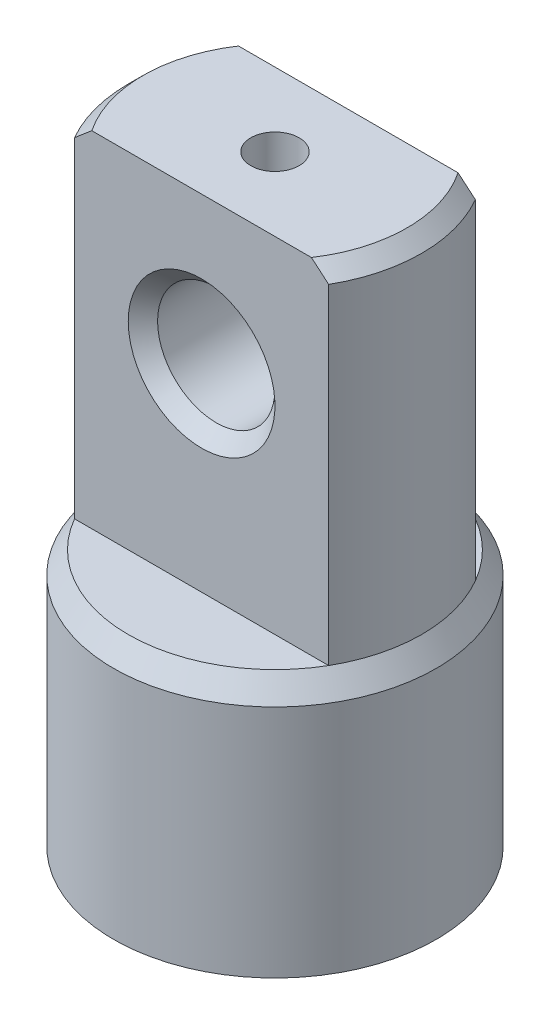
ISO-10303-21;
HEADER;
FILE_DESCRIPTION(('STEP AP214'),'2;1');
FILE_NAME('part.step','',(''),(''),'','','');
FILE_SCHEMA(('AUTOMOTIVE_DESIGN { 1 0 10303 214 1 1 1 1 }'));
ENDSEC;
DATA;
#1=APPLICATION_CONTEXT('core data for automotive mechanical design processes');
#2=APPLICATION_PROTOCOL_DEFINITION('international standard','automotive_design',2000,#1);
#3=PRODUCT_CONTEXT('',#1,'mechanical');
#4=PRODUCT('Part','Part','',(#3));
#5=PRODUCT_RELATED_PRODUCT_CATEGORY('part','',(#4));
#6=PRODUCT_DEFINITION_FORMATION('','',#4);
#7=PRODUCT_DEFINITION_CONTEXT('part definition',#1,'design');
#8=PRODUCT_DEFINITION('design','',#6,#7);
#9=PRODUCT_DEFINITION_SHAPE('','',#8);
#10=(LENGTH_UNIT() NAMED_UNIT(*) SI_UNIT(.MILLI.,.METRE.));
#11=(NAMED_UNIT(*) PLANE_ANGLE_UNIT() SI_UNIT($,.RADIAN.));
#12=(NAMED_UNIT(*) SI_UNIT($,.STERADIAN.) SOLID_ANGLE_UNIT());
#13=UNCERTAINTY_MEASURE_WITH_UNIT(LENGTH_MEASURE(1.E-05),#10,'distance_accuracy_value','');
#14=(GEOMETRIC_REPRESENTATION_CONTEXT(3) GLOBAL_UNCERTAINTY_ASSIGNED_CONTEXT((#13)) GLOBAL_UNIT_ASSIGNED_CONTEXT((#10,
#11,#12)) REPRESENTATION_CONTEXT('',''));
#15=CARTESIAN_POINT('',(0.,0.,0.));
#16=DIRECTION('',(0.,0.,1.));
#17=DIRECTION('',(1.,0.,0.));
#18=AXIS2_PLACEMENT_3D('',#15,#16,#17);
#19=CARTESIAN_POINT('',(-9.79795897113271,17.5,5.));
#20=DIRECTION('',(0.,0.,-1.));
#21=DIRECTION('',(-1.,0.,0.));
#22=AXIS2_PLACEMENT_3D('',#19,#20,#21);
#23=PLANE('',#22);
#24=CARTESIAN_POINT('',(0.,31.,5.));
#25=DIRECTION('',(0.,0.,-1.));
#26=DIRECTION('',(-1.,0.,0.));
#27=AXIS2_PLACEMENT_3D('',#24,#25,#26);
#28=CIRCLE('',#27,4.99999999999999);
#29=CARTESIAN_POINT('',(-4.99999999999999,31.,5.));
#30=VERTEX_POINT('',#29);
#31=EDGE_CURVE('E11',#30,#30,#28,.T.);
#32=ORIENTED_EDGE('',*,*,#31,.T.);
#33=EDGE_LOOP('',(#32));
#34=FACE_BOUND('',#33,.T.);
#35=DIRECTION('',(0.,-1.,0.));
#36=VECTOR('',#35,1.);
#37=CARTESIAN_POINT('',(8.66025403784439,0.,5.));
#38=LINE('',#37,#36);
#39=CARTESIAN_POINT('',(8.66025403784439,17.5,5.));
#40=VERTEX_POINT('',#39);
#41=CARTESIAN_POINT('',(8.66025403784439,40.,5.));
#42=VERTEX_POINT('',#41);
#43=EDGE_CURVE('E102',#40,#42,#38,.F.);
#44=ORIENTED_EDGE('',*,*,#43,.T.);
#45=CARTESIAN_POINT('',(8.66025403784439,40.,5.));
#46=CARTESIAN_POINT('',(8.56296249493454,40.0842556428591,5.));
#47=CARTESIAN_POINT('',(8.46549639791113,40.1683100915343,5.));
#48=CARTESIAN_POINT('',(8.27018469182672,40.3359718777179,5.));
#49=CARTESIAN_POINT('',(8.17233909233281,40.4195792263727,5.));
#50=CARTESIAN_POINT('',(7.97623273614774,40.5863066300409,5.));
#51=CARTESIAN_POINT('',(7.87797197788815,40.6694266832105,5.));
#52=CARTESIAN_POINT('',(7.6809944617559,40.8351296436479,5.));
#53=CARTESIAN_POINT('',(7.58227769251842,40.9177125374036,5.));
#54=CARTESIAN_POINT('',(7.48331477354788,41.,5.));
#55=B_SPLINE_CURVE_WITH_KNOTS('',3,(#45,#46,#47,#48,#49,#50,#51,#52,#53,#54),.UNSPECIFIED.,.F.,
.F.,(4,2,2,2,4),(0.,0.386111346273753,0.772213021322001,1.15831615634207,1.54442896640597),.UNSPECIFIED.);
#56=CARTESIAN_POINT('',(7.48331477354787,41.,5.));
#57=VERTEX_POINT('',#56);
#58=EDGE_CURVE('E179',#42,#57,#55,.T.);
#59=ORIENTED_EDGE('',*,*,#58,.T.);
#60=DIRECTION('',(-1.,0.,0.));
#61=VECTOR('',#60,1.);
#62=CARTESIAN_POINT('',(10.,41.,5.));
#63=LINE('',#62,#61);
#64=CARTESIAN_POINT('',(-7.48331477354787,41.,5.));
#65=VERTEX_POINT('',#64);
#66=EDGE_CURVE('E234',#57,#65,#63,.T.);
#67=ORIENTED_EDGE('',*,*,#66,.T.);
#68=CARTESIAN_POINT('',(-7.48331477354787,41.,5.));
#69=CARTESIAN_POINT('',(-7.58227769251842,40.9177125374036,5.));
#70=CARTESIAN_POINT('',(-7.68099446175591,40.8351296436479,5.));
#71=CARTESIAN_POINT('',(-7.87797197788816,40.6694266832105,5.));
#72=CARTESIAN_POINT('',(-7.97623273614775,40.5863066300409,5.));
#73=CARTESIAN_POINT('',(-8.17233909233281,40.4195792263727,5.));
#74=CARTESIAN_POINT('',(-8.27018469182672,40.3359718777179,5.));
#75=CARTESIAN_POINT('',(-8.46549639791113,40.1683100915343,5.));
#76=CARTESIAN_POINT('',(-8.56296249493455,40.0842556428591,5.));
#77=CARTESIAN_POINT('',(-8.66025403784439,40.,5.));
#78=B_SPLINE_CURVE_WITH_KNOTS('',3,(#68,#69,#70,#71,#72,#73,#74,#75,#76,#77),.UNSPECIFIED.,.F.,
.F.,(4,2,2,2,4),(0.,0.386112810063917,0.77221594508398,1.15831762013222,1.54442896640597),.UNSPECIFIED.);
#79=CARTESIAN_POINT('',(-8.66025403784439,40.,5.));
#80=VERTEX_POINT('',#79);
#81=EDGE_CURVE('E172',#65,#80,#78,.T.);
#82=ORIENTED_EDGE('',*,*,#81,.T.);
#83=DIRECTION('',(0.,-1.,0.));
#84=VECTOR('',#83,1.);
#85=CARTESIAN_POINT('',(-8.66025403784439,0.,5.));
#86=LINE('',#85,#84);
#87=CARTESIAN_POINT('',(-8.66025403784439,17.5,5.));
#88=VERTEX_POINT('',#87);
#89=EDGE_CURVE('E104',#80,#88,#86,.T.);
#90=ORIENTED_EDGE('',*,*,#89,.T.);
#91=DIRECTION('',(-1.,0.,0.));
#92=VECTOR('',#91,1.);
#93=CARTESIAN_POINT('',(-9.79795897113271,17.5,5.));
#94=LINE('',#93,#92);
#95=EDGE_CURVE('E91',#40,#88,#94,.T.);
#96=ORIENTED_EDGE('',*,*,#95,.F.);
#97=EDGE_LOOP('',(#44,#59,#67,#82,#90,#96));
#98=FACE_BOUND('',#97,.T.);
#99=ADVANCED_FACE('F32',(#34,#98),#23,.F.);
#100=CARTESIAN_POINT('',(0.,0.,0.));
#101=DIRECTION('',(0.,-1.,0.));
#102=DIRECTION('',(0.,0.,-1.));
#103=AXIS2_PLACEMENT_3D('',#100,#101,#102);
#104=CYLINDRICAL_SURFACE('',#103,10.);
#105=DIRECTION('',(0.,-1.,0.));
#106=VECTOR('',#105,1.);
#107=CARTESIAN_POINT('',(8.66025403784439,0.,-5.));
#108=LINE('',#107,#106);
#109=CARTESIAN_POINT('',(8.66025403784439,40.,-5.));
#110=VERTEX_POINT('',#109);
#111=CARTESIAN_POINT('',(8.66025403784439,17.5,-5.));
#112=VERTEX_POINT('',#111);
#113=EDGE_CURVE('E127',#110,#112,#108,.T.);
#114=ORIENTED_EDGE('',*,*,#113,.F.);
#115=CARTESIAN_POINT('',(0.,40.,0.));
#116=DIRECTION('',(0.,1.,0.));
#117=DIRECTION('',(0.,0.,1.));
#118=AXIS2_PLACEMENT_3D('',#115,#116,#117);
#119=CIRCLE('',#118,10.);
#120=EDGE_CURVE('E113',#110,#42,#119,.F.);
#121=ORIENTED_EDGE('',*,*,#120,.T.);
#122=ORIENTED_EDGE('',*,*,#43,.F.);
#123=CARTESIAN_POINT('',(0.,17.5,0.));
#124=DIRECTION('',(0.,-1.,0.));
#125=DIRECTION('',(0.,0.,-1.));
#126=AXIS2_PLACEMENT_3D('',#123,#124,#125);
#127=CIRCLE('',#126,10.);
#128=EDGE_CURVE('E95',#112,#40,#127,.T.);
#129=ORIENTED_EDGE('',*,*,#128,.F.);
#130=EDGE_LOOP('',(#114,#121,#122,#129));
#131=FACE_BOUND('',#130,.T.);
#132=ADVANCED_FACE('F111',(#131),#104,.T.);
#133=CARTESIAN_POINT('',(0.,0.,0.));
#134=DIRECTION('',(0.,-1.,0.));
#135=DIRECTION('',(0.,0.,-1.));
#136=AXIS2_PLACEMENT_3D('',#133,#134,#135);
#137=PLANE('',#136);
#138=CARTESIAN_POINT('',(0.,0.,0.));
#139=DIRECTION('',(0.,-1.,0.));
#140=DIRECTION('',(0.,0.,-1.));
#141=AXIS2_PLACEMENT_3D('',#138,#139,#140);
#142=CIRCLE('',#141,11.);
#143=CARTESIAN_POINT('',(0.,0.,-11.));
#144=VERTEX_POINT('',#143);
#145=EDGE_CURVE('E122',#144,#144,#142,.T.);
#146=ORIENTED_EDGE('',*,*,#145,.T.);
#147=EDGE_LOOP('',(#146));
#148=FACE_BOUND('',#147,.T.);
#149=ADVANCED_FACE('F162',(#148),#137,.T.);
#150=CARTESIAN_POINT('',(0.,0.,0.));
#151=DIRECTION('',(0.,-1.,0.));
#152=DIRECTION('',(0.,0.,-1.));
#153=AXIS2_PLACEMENT_3D('',#150,#151,#152);
#154=CYLINDRICAL_SURFACE('',#153,11.);
#155=CARTESIAN_POINT('',(0.,16.,0.));
#156=DIRECTION('',(0.,-1.,0.));
#157=DIRECTION('',(0.,0.,-1.));
#158=AXIS2_PLACEMENT_3D('',#155,#156,#157);
#159=CIRCLE('',#158,11.);
#160=CARTESIAN_POINT('',(0.,16.,-11.));
#161=VERTEX_POINT('',#160);
#162=EDGE_CURVE('E120',#161,#161,#159,.T.);
#163=ORIENTED_EDGE('',*,*,#162,.T.);
#164=EDGE_LOOP('',(#163));
#165=FACE_BOUND('',#164,.T.);
#166=ORIENTED_EDGE('',*,*,#145,.F.);
#167=EDGE_LOOP('',(#166));
#168=FACE_BOUND('',#167,.T.);
#169=ADVANCED_FACE('F221',(#165,#168),#154,.T.);
#170=CARTESIAN_POINT('',(0.,16.,0.));
#171=DIRECTION('',(0.,-1.,0.));
#172=DIRECTION('',(0.,0.,-1.));
#173=AXIS2_PLACEMENT_3D('',#170,#171,#172);
#174=CONICAL_SURFACE('',#173,11.,0.588002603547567);
#175=ORIENTED_EDGE('',*,*,#128,.T.);
#176=EDGE_CURVE('E88',#40,#88,#127,.T.);
#177=ORIENTED_EDGE('',*,*,#176,.T.);
#178=CARTESIAN_POINT('',(-8.66025403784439,17.5,-5.));
#179=VERTEX_POINT('',#178);
#180=EDGE_CURVE('E96',#88,#179,#127,.T.);
#181=ORIENTED_EDGE('',*,*,#180,.T.);
#182=EDGE_CURVE('E98',#179,#112,#127,.T.);
#183=ORIENTED_EDGE('',*,*,#182,.T.);
#184=EDGE_LOOP('',(#175,#177,#181,#183));
#185=FACE_BOUND('',#184,.T.);
#186=ORIENTED_EDGE('',*,*,#162,.F.);
#187=EDGE_LOOP('',(#186));
#188=FACE_BOUND('',#187,.T.);
#189=ADVANCED_FACE('F117',(#185,#188),#174,.T.);
#190=ORIENTED_EDGE('',*,*,#89,.F.);
#191=CARTESIAN_POINT('',(0.,40.,0.));
#192=DIRECTION('',(0.,1.,0.));
#193=DIRECTION('',(0.,0.,1.));
#194=AXIS2_PLACEMENT_3D('',#191,#192,#193);
#195=CIRCLE('',#194,10.);
#196=CARTESIAN_POINT('',(-8.66025403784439,40.,-5.));
#197=VERTEX_POINT('',#196);
#198=EDGE_CURVE('E203',#80,#197,#195,.F.);
#199=ORIENTED_EDGE('',*,*,#198,.T.);
#200=DIRECTION('',(0.,-1.,0.));
#201=VECTOR('',#200,1.);
#202=CARTESIAN_POINT('',(-8.66025403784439,0.,-5.));
#203=LINE('',#202,#201);
#204=EDGE_CURVE('E125',#179,#197,#203,.F.);
#205=ORIENTED_EDGE('',*,*,#204,.F.);
#206=ORIENTED_EDGE('',*,*,#180,.F.);
#207=EDGE_LOOP('',(#190,#199,#205,#206));
#208=FACE_BOUND('',#207,.T.);
#209=ADVANCED_FACE('F164',(#208),#104,.T.);
#210=CARTESIAN_POINT('',(10.,41.,0.));
#211=DIRECTION('',(0.,1.,0.));
#212=DIRECTION('',(0.,0.,1.));
#213=AXIS2_PLACEMENT_3D('',#210,#211,#212);
#214=PLANE('',#213);
#215=CARTESIAN_POINT('',(0.,41.,0.));
#216=DIRECTION('',(0.,1.,0.));
#217=DIRECTION('',(0.,0.,1.));
#218=AXIS2_PLACEMENT_3D('',#215,#216,#217);
#219=CIRCLE('',#218,1.65);
#220=CARTESIAN_POINT('',(0.,41.,1.65));
#221=VERTEX_POINT('',#220);
#222=EDGE_CURVE('E142',#221,#221,#219,.T.);
#223=ORIENTED_EDGE('',*,*,#222,.F.);
#224=EDGE_LOOP('',(#223));
#225=FACE_BOUND('',#224,.T.);
#226=ORIENTED_EDGE('',*,*,#66,.F.);
#227=CARTESIAN_POINT('',(0.,41.,0.));
#228=DIRECTION('',(0.,1.,0.));
#229=DIRECTION('',(0.,0.,1.));
#230=AXIS2_PLACEMENT_3D('',#227,#228,#229);
#231=CIRCLE('',#230,8.99999999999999);
#232=CARTESIAN_POINT('',(7.48331477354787,41.,-5.));
#233=VERTEX_POINT('',#232);
#234=EDGE_CURVE('E55',#57,#233,#231,.T.);
#235=ORIENTED_EDGE('',*,*,#234,.T.);
#236=DIRECTION('',(1.,0.,0.));
#237=VECTOR('',#236,1.);
#238=CARTESIAN_POINT('',(10.,41.,-5.));
#239=LINE('',#238,#237);
#240=CARTESIAN_POINT('',(-7.48331477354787,41.,-5.));
#241=VERTEX_POINT('',#240);
#242=EDGE_CURVE('E232',#241,#233,#239,.T.);
#243=ORIENTED_EDGE('',*,*,#242,.F.);
#244=CARTESIAN_POINT('',(0.,41.,0.));
#245=DIRECTION('',(0.,1.,0.));
#246=DIRECTION('',(0.,0.,1.));
#247=AXIS2_PLACEMENT_3D('',#244,#245,#246);
#248=CIRCLE('',#247,8.99999999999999);
#249=EDGE_CURVE('E185',#241,#65,#248,.T.);
#250=ORIENTED_EDGE('',*,*,#249,.T.);
#251=EDGE_LOOP('',(#226,#235,#243,#250));
#252=FACE_BOUND('',#251,.T.);
#253=ADVANCED_FACE('F212',(#225,#252),#214,.T.);
#254=CARTESIAN_POINT('',(-9.79795897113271,17.5,-5.));
#255=DIRECTION('',(0.,0.,1.));
#256=DIRECTION('',(1.,0.,0.));
#257=AXIS2_PLACEMENT_3D('',#254,#255,#256);
#258=PLANE('',#257);
#259=CARTESIAN_POINT('',(0.,31.,-5.));
#260=DIRECTION('',(0.,0.,1.));
#261=DIRECTION('',(1.,0.,0.));
#262=AXIS2_PLACEMENT_3D('',#259,#260,#261);
#263=CIRCLE('',#262,4.99999999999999);
#264=CARTESIAN_POINT('',(4.99999999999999,31.,-5.));
#265=VERTEX_POINT('',#264);
#266=EDGE_CURVE('E239',#265,#265,#263,.T.);
#267=ORIENTED_EDGE('',*,*,#266,.T.);
#268=EDGE_LOOP('',(#267));
#269=FACE_BOUND('',#268,.T.);
#270=ORIENTED_EDGE('',*,*,#242,.T.);
#271=CARTESIAN_POINT('',(7.48331477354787,41.,-5.));
#272=CARTESIAN_POINT('',(7.58227769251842,40.9177125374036,-5.));
#273=CARTESIAN_POINT('',(7.68099446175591,40.8351296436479,-5.));
#274=CARTESIAN_POINT('',(7.87797197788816,40.6694266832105,-5.));
#275=CARTESIAN_POINT('',(7.97623273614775,40.5863066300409,-5.));
#276=CARTESIAN_POINT('',(8.17233909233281,40.4195792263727,-5.));
#277=CARTESIAN_POINT('',(8.27018469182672,40.3359718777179,-5.));
#278=CARTESIAN_POINT('',(8.46549639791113,40.1683100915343,-5.));
#279=CARTESIAN_POINT('',(8.56296249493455,40.0842556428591,-5.));
#280=CARTESIAN_POINT('',(8.66025403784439,40.,-5.));
#281=B_SPLINE_CURVE_WITH_KNOTS('',3,(#271,#272,#273,#274,#275,#276,#277,#278,#279,#280),
.UNSPECIFIED.,.F.,.F.,(4,2,2,2,4),(0.,0.386112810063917,0.77221594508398,1.15831762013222,
1.54442896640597),.UNSPECIFIED.);
#282=EDGE_CURVE('E197',#233,#110,#281,.T.);
#283=ORIENTED_EDGE('',*,*,#282,.T.);
#284=ORIENTED_EDGE('',*,*,#113,.T.);
#285=DIRECTION('',(1.,0.,0.));
#286=VECTOR('',#285,1.);
#287=CARTESIAN_POINT('',(-9.79795897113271,17.5,-5.));
#288=LINE('',#287,#286);
#289=EDGE_CURVE('E114',#179,#112,#288,.T.);
#290=ORIENTED_EDGE('',*,*,#289,.F.);
#291=ORIENTED_EDGE('',*,*,#204,.T.);
#292=CARTESIAN_POINT('',(-8.66025403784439,40.,-5.));
#293=CARTESIAN_POINT('',(-8.56296249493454,40.0842556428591,-5.));
#294=CARTESIAN_POINT('',(-8.46549639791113,40.1683100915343,-5.));
#295=CARTESIAN_POINT('',(-8.27018469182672,40.3359718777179,-5.));
#296=CARTESIAN_POINT('',(-8.17233909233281,40.4195792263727,-5.));
#297=CARTESIAN_POINT('',(-7.97623273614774,40.5863066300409,-5.));
#298=CARTESIAN_POINT('',(-7.87797197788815,40.6694266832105,-5.));
#299=CARTESIAN_POINT('',(-7.6809944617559,40.8351296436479,-5.));
#300=CARTESIAN_POINT('',(-7.58227769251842,40.9177125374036,-5.));
#301=CARTESIAN_POINT('',(-7.48331477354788,41.,-5.));
#302=B_SPLINE_CURVE_WITH_KNOTS('',3,(#292,#293,#294,#295,#296,#297,#298,#299,#300,#301),
.UNSPECIFIED.,.F.,.F.,(4,2,2,2,4),(0.,0.386111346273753,0.772213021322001,1.15831615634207,
1.54442896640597),.UNSPECIFIED.);
#303=EDGE_CURVE('E47',#197,#241,#302,.T.);
#304=ORIENTED_EDGE('',*,*,#303,.T.);
#305=EDGE_LOOP('',(#270,#283,#284,#290,#291,#304));
#306=FACE_BOUND('',#305,.T.);
#307=ADVANCED_FACE('F208',(#269,#306),#258,.F.);
#308=CARTESIAN_POINT('',(0.,17.5,0.));
#309=DIRECTION('',(0.,1.,0.));
#310=DIRECTION('',(0.,0.,1.));
#311=AXIS2_PLACEMENT_3D('',#308,#309,#310);
#312=PLANE('',#311);
#313=ORIENTED_EDGE('',*,*,#289,.T.);
#314=ORIENTED_EDGE('',*,*,#182,.F.);
#315=EDGE_LOOP('',(#313,#314));
#316=FACE_BOUND('',#315,.T.);
#317=ADVANCED_FACE('F168',(#316),#312,.T.);
#318=CARTESIAN_POINT('',(0.,17.5,0.));
#319=DIRECTION('',(0.,1.,0.));
#320=DIRECTION('',(0.,0.,1.));
#321=AXIS2_PLACEMENT_3D('',#318,#319,#320);
#322=PLANE('',#321);
#323=ORIENTED_EDGE('',*,*,#95,.T.);
#324=ORIENTED_EDGE('',*,*,#176,.F.);
#325=EDGE_LOOP('',(#323,#324));
#326=FACE_BOUND('',#325,.T.);
#327=ADVANCED_FACE('F90',(#326),#322,.T.);
#328=CARTESIAN_POINT('',(0.,40.,0.));
#329=DIRECTION('',(0.,-1.,0.));
#330=DIRECTION('',(0.,0.,-1.));
#331=AXIS2_PLACEMENT_3D('',#328,#329,#330);
#332=CONICAL_SURFACE('',#331,10.,0.785398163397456);
#333=ORIENTED_EDGE('',*,*,#282,.F.);
#334=ORIENTED_EDGE('',*,*,#234,.F.);
#335=ORIENTED_EDGE('',*,*,#58,.F.);
#336=ORIENTED_EDGE('',*,*,#120,.F.);
#337=EDGE_LOOP('',(#333,#334,#335,#336));
#338=FACE_BOUND('',#337,.T.);
#339=ADVANCED_FACE('F187',(#338),#332,.T.);
#340=CARTESIAN_POINT('',(0.,40.,0.));
#341=DIRECTION('',(0.,-1.,0.));
#342=DIRECTION('',(0.,0.,-1.));
#343=AXIS2_PLACEMENT_3D('',#340,#341,#342);
#344=CONICAL_SURFACE('',#343,10.,0.785398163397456);
#345=ORIENTED_EDGE('',*,*,#81,.F.);
#346=ORIENTED_EDGE('',*,*,#249,.F.);
#347=ORIENTED_EDGE('',*,*,#303,.F.);
#348=ORIENTED_EDGE('',*,*,#198,.F.);
#349=EDGE_LOOP('',(#345,#346,#347,#348));
#350=FACE_BOUND('',#349,.T.);
#351=ADVANCED_FACE('F191',(#350),#344,.T.);
#352=CARTESIAN_POINT('',(0.,31.,5.));
#353=DIRECTION('',(0.,0.,1.));
#354=DIRECTION('',(1.,0.,0.));
#355=AXIS2_PLACEMENT_3D('',#352,#353,#354);
#356=CYLINDRICAL_SURFACE('',#355,4.);
#357=CARTESIAN_POINT('',(0.,35.,1.65));
#358=CARTESIAN_POINT('',(0.088459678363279,34.9999930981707,1.64999078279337));
#359=CARTESIAN_POINT('',(0.177062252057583,34.9970314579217,1.64284398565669));
#360=CARTESIAN_POINT('',(0.351759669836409,34.9854711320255,1.6145088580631));
#361=CARTESIAN_POINT('',(0.437847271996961,34.9768575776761,1.59328348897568));
#362=CARTESIAN_POINT('',(0.604702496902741,34.9549196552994,1.53770518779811));
#363=CARTESIAN_POINT('',(0.685486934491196,34.9416111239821,1.50339635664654));
#364=CARTESIAN_POINT('',(0.840076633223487,34.9115828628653,1.42280524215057));
#365=CARTESIAN_POINT('',(0.913884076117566,34.8948642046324,1.37652671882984));
#366=CARTESIAN_POINT('',(1.05618769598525,34.8587690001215,1.27089324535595));
#367=CARTESIAN_POINT('',(1.12429373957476,34.8393065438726,1.21104232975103));
#368=CARTESIAN_POINT('',(1.24983574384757,34.800294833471,1.08101116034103));
#369=CARTESIAN_POINT('',(1.30726618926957,34.7807455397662,1.01082560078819));
#370=CARTESIAN_POINT('',(1.41254826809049,34.7427255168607,0.858031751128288));
#371=CARTESIAN_POINT('',(1.45980781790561,34.7243515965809,0.774988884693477));
#372=CARTESIAN_POINT('',(1.53951358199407,34.6921213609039,0.601263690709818));
#373=CARTESIAN_POINT('',(1.57196727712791,34.6782627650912,0.510585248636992));
#374=CARTESIAN_POINT('',(1.61953738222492,34.6575602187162,0.328652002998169));
#375=CARTESIAN_POINT('',(1.63540371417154,34.6504144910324,0.237628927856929));
#376=CARTESIAN_POINT('',(1.65168918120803,34.643077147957,0.0539534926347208));
#377=CARTESIAN_POINT('',(1.65211659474,34.6428818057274,-0.0386979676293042));
#378=CARTESIAN_POINT('',(1.6380778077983,34.6492113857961,-0.215598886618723));
#379=CARTESIAN_POINT('',(1.62472398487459,34.6552343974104,-0.299958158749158));
#380=CARTESIAN_POINT('',(1.58536484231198,34.6724753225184,-0.465110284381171));
#381=CARTESIAN_POINT('',(1.55935715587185,34.6836942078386,-0.545902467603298));
#382=CARTESIAN_POINT('',(1.49492412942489,34.7103145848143,-0.703645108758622));
#383=CARTESIAN_POINT('',(1.45624866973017,34.7257992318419,-0.780478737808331));
#384=CARTESIAN_POINT('',(1.36775445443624,34.7591861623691,-0.926860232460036));
#385=CARTESIAN_POINT('',(1.31793135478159,34.7770893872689,-0.996405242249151));
#386=CARTESIAN_POINT('',(1.20371911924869,34.8150974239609,-1.13228640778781));
#387=CARTESIAN_POINT('',(1.13846630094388,34.8352618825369,-1.19788195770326));
#388=CARTESIAN_POINT('',(0.997682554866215,34.8742691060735,-1.31744467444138));
#389=CARTESIAN_POINT('',(0.922149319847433,34.8931115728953,-1.37140922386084));
#390=CARTESIAN_POINT('',(0.760736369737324,34.9278793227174,-1.46723477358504));
#391=CARTESIAN_POINT('',(0.674664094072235,34.9437305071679,-1.50880028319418));
#392=CARTESIAN_POINT('',(0.495928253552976,34.9701631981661,-1.57660302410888));
#393=CARTESIAN_POINT('',(0.403268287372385,34.9807475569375,-1.60284855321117));
#394=CARTESIAN_POINT('',(0.220181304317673,34.9949245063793,-1.63772950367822));
#395=CARTESIAN_POINT('',(0.129974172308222,34.9989112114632,-1.64735917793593));
#396=CARTESIAN_POINT('',(-0.0508474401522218,35.0006974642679,-1.6516920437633));
#397=CARTESIAN_POINT('',(-0.141461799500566,34.9984987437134,-1.64639941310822));
#398=CARTESIAN_POINT('',(-0.315907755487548,34.9884174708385,-1.62175473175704));
#399=CARTESIAN_POINT('',(-0.399855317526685,34.9808153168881,-1.60309592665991));
#400=CARTESIAN_POINT('',(-0.563340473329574,34.9609888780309,-1.55320790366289));
#401=CARTESIAN_POINT('',(-0.642877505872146,34.9487640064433,-1.52197709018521));
#402=CARTESIAN_POINT('',(-0.798061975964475,34.9203972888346,-1.44681062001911));
#403=CARTESIAN_POINT('',(-0.873512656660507,34.9041458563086,-1.40251143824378));
#404=CARTESIAN_POINT('',(-1.01617847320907,34.8694676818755,-1.30286606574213));
#405=CARTESIAN_POINT('',(-1.0833901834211,34.851040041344,-1.24751530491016));
#406=CARTESIAN_POINT('',(-1.21261994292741,34.8124029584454,-1.12279569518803));
#407=CARTESIAN_POINT('',(-1.27394364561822,34.7921591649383,-1.0527161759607));
#408=CARTESIAN_POINT('',(-1.38414835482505,34.7533392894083,-0.902928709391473));
#409=CARTESIAN_POINT('',(-1.43302674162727,34.7347635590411,-0.823218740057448));
#410=CARTESIAN_POINT('',(-1.51742282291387,34.7012870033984,-0.654904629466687));
#411=CARTESIAN_POINT('',(-1.55275802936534,34.686437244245,-0.566198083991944));
#412=CARTESIAN_POINT('',(-1.60769618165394,34.6628164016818,-0.383290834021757));
#413=CARTESIAN_POINT('',(-1.62731175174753,34.6540404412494,-0.289094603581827));
#414=CARTESIAN_POINT('',(-1.64901123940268,34.6442955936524,-0.105569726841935));
#415=CARTESIAN_POINT('',(-1.65231049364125,34.6427857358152,-0.0164127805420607));
#416=CARTESIAN_POINT('',(-1.64451485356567,34.646311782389,0.161128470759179));
#417=CARTESIAN_POINT('',(-1.6334220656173,34.651346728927,0.249512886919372));
#418=CARTESIAN_POINT('',(-1.59817118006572,34.666904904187,0.418933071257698));
#419=CARTESIAN_POINT('',(-1.57461958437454,34.6771726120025,0.500120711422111));
#420=CARTESIAN_POINT('',(-1.51570599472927,34.7018441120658,0.657414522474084));
#421=CARTESIAN_POINT('',(-1.48034069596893,34.7162490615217,0.73351926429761));
#422=CARTESIAN_POINT('',(-1.3963806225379,34.7486340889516,0.883422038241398));
#423=CARTESIAN_POINT('',(-1.34712443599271,34.76677577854,0.956814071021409));
#424=CARTESIAN_POINT('',(-1.23771718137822,34.8041286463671,1.09467168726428));
#425=CARTESIAN_POINT('',(-1.17756245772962,34.8233401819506,1.15913426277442));
#426=CARTESIAN_POINT('',(-1.04300738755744,34.8623017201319,1.28199413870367));
#427=CARTESIAN_POINT('',(-0.967900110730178,34.8819935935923,1.33963922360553));
#428=CARTESIAN_POINT('',(-0.808343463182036,34.9183242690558,1.44154015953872));
#429=CARTESIAN_POINT('',(-0.723889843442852,34.9349616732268,1.4857898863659));
#430=CARTESIAN_POINT('',(-0.549414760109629,34.9630569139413,1.55866373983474));
#431=CARTESIAN_POINT('',(-0.459513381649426,34.9745985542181,1.58754242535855));
#432=CARTESIAN_POINT('',(-0.275719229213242,34.9915443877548,1.62951108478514));
#433=CARTESIAN_POINT('',(-0.18183996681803,34.9969678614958,1.64265066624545));
#434=CARTESIAN_POINT('',(-0.0584442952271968,34.9996819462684,1.64922677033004));
#435=CARTESIAN_POINT('',(-0.0292299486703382,35.0000022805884,1.65000304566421));
#436=CARTESIAN_POINT('',(0.,35.,1.65));
#437=B_SPLINE_CURVE_WITH_KNOTS('',3,(#357,#358,#359,#360,#361,#362,#363,#364,#365,#366,#367,
#368,#369,#370,#371,#372,#373,#374,#375,#376,#377,#378,#379,#380,#381,#382,#383,#384,#385,#386,
#387,#388,#389,#390,#391,#392,#393,#394,#395,#396,#397,#398,#399,#400,#401,#402,#403,#404,#405,
#406,#407,#408,#409,#410,#411,#412,#413,#414,#415,#416,#417,#418,#419,#420,#421,#422,#423,#424,
#425,#426,#427,#428,#429,#430,#431,#432,#433,#434,#435,#436),.UNSPECIFIED.,.T.,.F.,(4,2,2,2,2,2,
2,2,2,2,2,2,2,2,2,2,2,2,2,2,2,2,2,2,2,2,2,2,2,2,2,2,2,2,2,2,2,2,2,4),(0.,0.26529709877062,
0.53129493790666,0.79640398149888,1.06142984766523,1.33841878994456,1.61555043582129,
1.90598404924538,2.19627075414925,2.47277648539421,2.7491339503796,3.00480633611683,
3.26052656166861,3.52163539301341,3.78284615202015,4.06565185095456,4.34852112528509,
4.63767392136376,4.92666995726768,5.19768149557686,5.46861716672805,5.72643264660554,
5.98428085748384,6.25011488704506,6.51605907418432,6.80064580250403,7.08529238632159,
7.37364985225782,7.66177550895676,7.92807823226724,8.19434198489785,8.4486977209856,
8.70312467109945,8.9726747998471,9.24231550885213,9.53104085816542,9.81989801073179,
10.1038095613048,10.3868238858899,10.4744866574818),.UNSPECIFIED.);
#438=CARTESIAN_POINT('',(0.,35.,1.65));
#439=VERTEX_POINT('',#438);
#440=EDGE_CURVE('E105',#439,#439,#437,.T.);
#441=ORIENTED_EDGE('',*,*,#440,.T.);
#442=EDGE_LOOP('',(#441));
#443=FACE_BOUND('',#442,.T.);
#444=CARTESIAN_POINT('',(0.,31.,-4.));
#445=DIRECTION('',(0.,0.,1.));
#446=DIRECTION('',(1.,0.,0.));
#447=AXIS2_PLACEMENT_3D('',#444,#445,#446);
#448=CIRCLE('',#447,4.);
#449=CARTESIAN_POINT('',(4.,31.,-4.));
#450=VERTEX_POINT('',#449);
#451=EDGE_CURVE('E40',#450,#450,#448,.F.);
#452=ORIENTED_EDGE('',*,*,#451,.T.);
#453=EDGE_LOOP('',(#452));
#454=FACE_BOUND('',#453,.T.);
#455=CARTESIAN_POINT('',(0.,31.,4.));
#456=DIRECTION('',(0.,0.,-1.));
#457=DIRECTION('',(-1.,0.,0.));
#458=AXIS2_PLACEMENT_3D('',#455,#456,#457);
#459=CIRCLE('',#458,4.);
#460=CARTESIAN_POINT('',(-4.,31.,4.));
#461=VERTEX_POINT('',#460);
#462=EDGE_CURVE('E241',#461,#461,#459,.F.);
#463=ORIENTED_EDGE('',*,*,#462,.T.);
#464=EDGE_LOOP('',(#463));
#465=FACE_BOUND('',#464,.T.);
#466=ADVANCED_FACE('F248',(#443,#454,#465),#356,.F.);
#467=CARTESIAN_POINT('',(0.,31.,-5.));
#468=DIRECTION('',(0.,0.,-1.));
#469=DIRECTION('',(-1.,0.,0.));
#470=AXIS2_PLACEMENT_3D('',#467,#468,#469);
#471=CONICAL_SURFACE('',#470,4.99999999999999,0.785398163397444);
#472=ORIENTED_EDGE('',*,*,#451,.F.);
#473=EDGE_LOOP('',(#472));
#474=FACE_BOUND('',#473,.T.);
#475=ORIENTED_EDGE('',*,*,#266,.F.);
#476=EDGE_LOOP('',(#475));
#477=FACE_BOUND('',#476,.T.);
#478=ADVANCED_FACE('F152',(#474,#477),#471,.F.);
#479=CARTESIAN_POINT('',(0.,31.,4.));
#480=DIRECTION('',(0.,0.,1.));
#481=DIRECTION('',(1.,0.,0.));
#482=AXIS2_PLACEMENT_3D('',#479,#480,#481);
#483=CONICAL_SURFACE('',#482,4.,0.785398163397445);
#484=ORIENTED_EDGE('',*,*,#31,.F.);
#485=EDGE_LOOP('',(#484));
#486=FACE_BOUND('',#485,.T.);
#487=ORIENTED_EDGE('',*,*,#462,.F.);
#488=EDGE_LOOP('',(#487));
#489=FACE_BOUND('',#488,.T.);
#490=ADVANCED_FACE('F34',(#486,#489),#483,.F.);
#491=CARTESIAN_POINT('',(0.,41.,0.));
#492=DIRECTION('',(0.,1.,0.));
#493=DIRECTION('',(0.,0.,1.));
#494=AXIS2_PLACEMENT_3D('',#491,#492,#493);
#495=CYLINDRICAL_SURFACE('',#494,1.65);
#496=ORIENTED_EDGE('',*,*,#440,.F.);
#497=EDGE_LOOP('',(#496));
#498=FACE_BOUND('',#497,.T.);
#499=ORIENTED_EDGE('',*,*,#222,.T.);
#500=EDGE_LOOP('',(#499));
#501=FACE_BOUND('',#500,.T.);
#502=ADVANCED_FACE('F145',(#498,#501),#495,.F.);
#503=CLOSED_SHELL('',(#99,#132,#149,#169,#189,#209,#253,#307,#317,#327,#339,#351,#466,#478,#490,#502));
#504=MANIFOLD_SOLID_BREP('B2',#503);
#505=ADVANCED_BREP_SHAPE_REPRESENTATION('',(#18,#504),#14);
#506=SHAPE_DEFINITION_REPRESENTATION(#9,#505);
ENDSEC;
END-ISO-10303-21;
